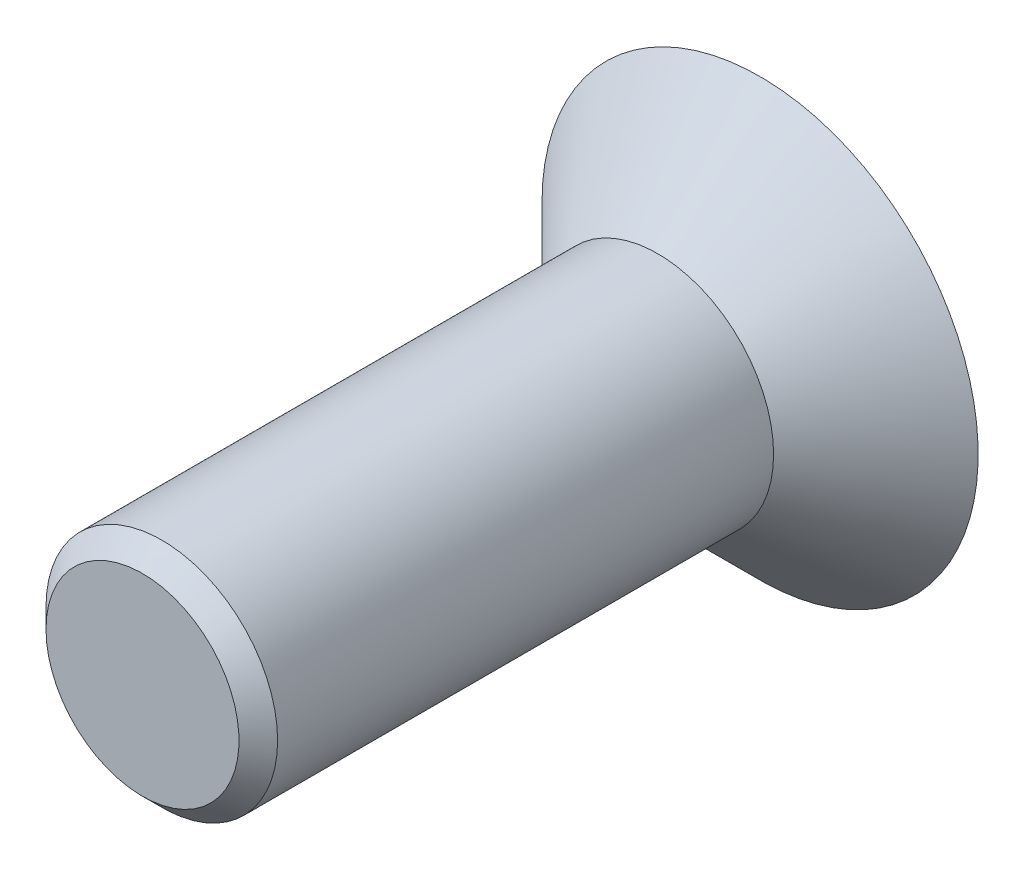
from build123d import *

# Parameters (mm, degrees)
PROFIL_T_TE_R         = 5.65
TETE_DEPTH            = 2.65
SIX_PANS_DEPTH        = 1.65625
PROFIL_CYLINDRE_R     = 3
CYLINDRE_FILETE_DEPTH = 13.35


with BuildPart() as part:
    # profil t_te → TETE (new body)
    with BuildSketch(Plane.XY):
        Circle(PROFIL_T_TE_R)
    extrude(amount=TETE_DEPTH)

    # profil fraisage → FRAISAGE (revolve, cut)
    with BuildSketch(Plane(origin=(0, 0, 0), x_dir=(0, 0, -1), z_dir=(1, 0, 0)), mode=Mode.PRIVATE) as fraisage_sk:
        Polygon((0, 5.65), (-2.65, 3), (-2.65, 5.65), align=None)
    revolve(fraisage_sk.sketch.rotate(Axis((0, 0, 0.272278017), (0, 0, 1)), 90), axis=Axis((0, 0, 0.272278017), (0, 0, 1)), mode=Mode.SUBTRACT)

    # profil six pans → SIX PANS (cut)
    with BuildSketch(Plane(origin=(0, 0, 0), x_dir=(-1, 0, 0), z_dir=(0, 0, -1))):
        Polygon((-2, 1.154700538), (-2, -1.154700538), (0, -2.309401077), (2, -1.154700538), (2, 1.154700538), (0, 2.309401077), align=None)
    extrude(amount=-SIX_PANS_DEPTH, mode=Mode.SUBTRACT)

    # profil cylindre → CYLINDRE FILETE (add)
    with BuildSketch(Plane.XY.offset(2.65)):
        Circle(PROFIL_CYLINDRE_R)
    extrude(amount=CYLINDRE_FILETE_DEPTH)

    # profil chanfrein → CHANFREIN FILET (revolve, cut)
    with BuildSketch(Plane(origin=(0, 0, 0), x_dir=(0, 0, -1), z_dir=(1, 0, 0)), mode=Mode.PRIVATE) as chanfrein_filet_sk:
        Polygon((-16, 2.5), (-15.5, 3), (-16, 3), align=None)
    revolve(chanfrein_filet_sk.sketch.rotate(Axis((0, 0, 12.087417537), (0, 0, 1)), 90), axis=Axis((0, 0, 12.087417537), (0, 0, 1)), mode=Mode.SUBTRACT)


solid = part.part
